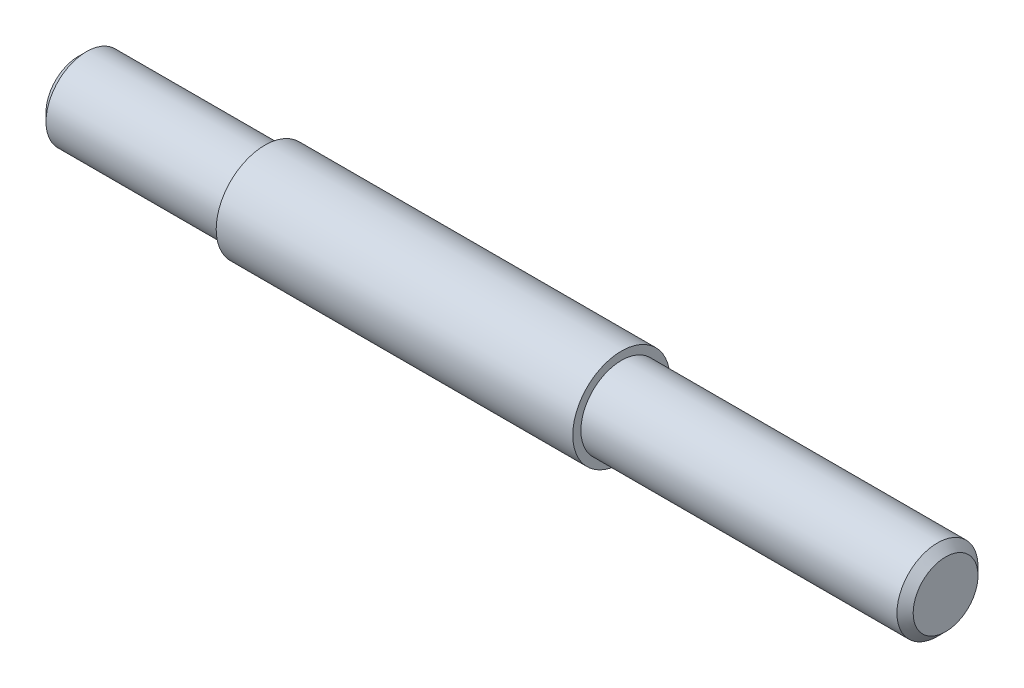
ISO-10303-21;
HEADER;
FILE_DESCRIPTION(('STEP AP214'),'2;1');
FILE_NAME('part.step','',(''),(''),'','','');
FILE_SCHEMA(('AUTOMOTIVE_DESIGN { 1 0 10303 214 1 1 1 1 }'));
ENDSEC;
DATA;
#1=APPLICATION_CONTEXT('core data for automotive mechanical design processes');
#2=APPLICATION_PROTOCOL_DEFINITION('international standard','automotive_design',2000,#1);
#3=PRODUCT_CONTEXT('',#1,'mechanical');
#4=PRODUCT('Part','Part','',(#3));
#5=PRODUCT_RELATED_PRODUCT_CATEGORY('part','',(#4));
#6=PRODUCT_DEFINITION_FORMATION('','',#4);
#7=PRODUCT_DEFINITION_CONTEXT('part definition',#1,'design');
#8=PRODUCT_DEFINITION('design','',#6,#7);
#9=PRODUCT_DEFINITION_SHAPE('','',#8);
#10=(LENGTH_UNIT() NAMED_UNIT(*) SI_UNIT(.MILLI.,.METRE.));
#11=(NAMED_UNIT(*) PLANE_ANGLE_UNIT() SI_UNIT($,.RADIAN.));
#12=(NAMED_UNIT(*) SI_UNIT($,.STERADIAN.) SOLID_ANGLE_UNIT());
#13=UNCERTAINTY_MEASURE_WITH_UNIT(LENGTH_MEASURE(1.E-05),#10,'distance_accuracy_value','');
#14=(GEOMETRIC_REPRESENTATION_CONTEXT(3) GLOBAL_UNCERTAINTY_ASSIGNED_CONTEXT((#13)) GLOBAL_UNIT_ASSIGNED_CONTEXT((#10,
#11,#12)) REPRESENTATION_CONTEXT('',''));
#15=CARTESIAN_POINT('',(0.,0.,0.));
#16=DIRECTION('',(0.,0.,1.));
#17=DIRECTION('',(1.,0.,0.));
#18=AXIS2_PLACEMENT_3D('',#15,#16,#17);
#19=CARTESIAN_POINT('',(0.,0.,0.));
#20=DIRECTION('',(1.,0.,0.));
#21=DIRECTION('',(0.,0.,-1.));
#22=AXIS2_PLACEMENT_3D('',#19,#20,#21);
#23=PLANE('',#22);
#24=CARTESIAN_POINT('',(0.,0.,0.));
#25=DIRECTION('',(1.,0.,0.));
#26=DIRECTION('',(0.,0.,-1.));
#27=AXIS2_PLACEMENT_3D('',#24,#25,#26);
#28=CIRCLE('',#27,3.99999999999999);
#29=CARTESIAN_POINT('',(0.,0.,-4.));
#30=VERTEX_POINT('',#29);
#31=EDGE_CURVE('E48',#30,#30,#28,.F.);
#32=ORIENTED_EDGE('',*,*,#31,.T.);
#33=EDGE_LOOP('',(#32));
#34=FACE_BOUND('',#33,.T.);
#35=ADVANCED_FACE('F34',(#34),#23,.F.);
#36=CARTESIAN_POINT('',(-12.1885906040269,2.22044604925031E-13,0.));
#37=DIRECTION('',(-1.,0.,0.));
#38=DIRECTION('',(0.,0.,1.));
#39=AXIS2_PLACEMENT_3D('',#36,#37,#38);
#40=CYLINDRICAL_SURFACE('',#39,4.99999999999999);
#41=CARTESIAN_POINT('',(0.999999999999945,0.,0.));
#42=DIRECTION('',(1.,0.,0.));
#43=DIRECTION('',(0.,0.,-1.));
#44=AXIS2_PLACEMENT_3D('',#41,#42,#43);
#45=CIRCLE('',#44,4.99999999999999);
#46=CARTESIAN_POINT('',(0.999999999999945,0.,-5.));
#47=VERTEX_POINT('',#46);
#48=EDGE_CURVE('E44',#47,#47,#45,.T.);
#49=ORIENTED_EDGE('',*,*,#48,.T.);
#50=EDGE_LOOP('',(#49));
#51=FACE_BOUND('',#50,.T.);
#52=CARTESIAN_POINT('',(23.,0.,0.));
#53=DIRECTION('',(-1.,0.,0.));
#54=DIRECTION('',(0.,0.,1.));
#55=AXIS2_PLACEMENT_3D('',#52,#53,#54);
#56=CIRCLE('',#55,4.99999999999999);
#57=CARTESIAN_POINT('',(23.,0.,5.));
#58=VERTEX_POINT('',#57);
#59=EDGE_CURVE('E53',#58,#58,#56,.T.);
#60=ORIENTED_EDGE('',*,*,#59,.T.);
#61=EDGE_LOOP('',(#60));
#62=FACE_BOUND('',#61,.T.);
#63=ADVANCED_FACE('F82',(#51,#62),#40,.T.);
#64=CARTESIAN_POINT('',(23.,5.,0.));
#65=DIRECTION('',(1.,0.,0.));
#66=DIRECTION('',(0.,0.,-1.));
#67=AXIS2_PLACEMENT_3D('',#64,#65,#66);
#68=PLANE('',#67);
#69=ORIENTED_EDGE('',*,*,#59,.F.);
#70=EDGE_LOOP('',(#69));
#71=FACE_BOUND('',#70,.T.);
#72=CARTESIAN_POINT('',(23.,0.,0.));
#73=DIRECTION('',(-1.,0.,0.));
#74=DIRECTION('',(0.,0.,1.));
#75=AXIS2_PLACEMENT_3D('',#72,#73,#74);
#76=CIRCLE('',#75,5.99999999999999);
#77=CARTESIAN_POINT('',(23.,0.,6.));
#78=VERTEX_POINT('',#77);
#79=EDGE_CURVE('E56',#78,#78,#76,.T.);
#80=ORIENTED_EDGE('',*,*,#79,.T.);
#81=EDGE_LOOP('',(#80));
#82=FACE_BOUND('',#81,.T.);
#83=ADVANCED_FACE('F87',(#71,#82),#68,.F.);
#84=CARTESIAN_POINT('',(-12.1885906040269,2.22044604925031E-13,0.));
#85=DIRECTION('',(-1.,0.,0.));
#86=DIRECTION('',(0.,0.,1.));
#87=AXIS2_PLACEMENT_3D('',#84,#85,#86);
#88=CYLINDRICAL_SURFACE('',#87,5.99999999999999);
#89=ORIENTED_EDGE('',*,*,#79,.F.);
#90=EDGE_LOOP('',(#89));
#91=FACE_BOUND('',#90,.T.);
#92=CARTESIAN_POINT('',(67.0000000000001,0.,0.));
#93=DIRECTION('',(-1.,0.,0.));
#94=DIRECTION('',(0.,0.,1.));
#95=AXIS2_PLACEMENT_3D('',#92,#93,#94);
#96=CIRCLE('',#95,5.99999999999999);
#97=CARTESIAN_POINT('',(67.0000000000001,0.,6.00000000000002));
#98=VERTEX_POINT('',#97);
#99=EDGE_CURVE('E59',#98,#98,#96,.T.);
#100=ORIENTED_EDGE('',*,*,#99,.T.);
#101=EDGE_LOOP('',(#100));
#102=FACE_BOUND('',#101,.T.);
#103=ADVANCED_FACE('F78',(#91,#102),#88,.T.);
#104=CARTESIAN_POINT('',(67.0000000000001,6.00000000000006,0.));
#105=DIRECTION('',(-1.,0.,0.));
#106=DIRECTION('',(0.,0.,1.));
#107=AXIS2_PLACEMENT_3D('',#104,#105,#106);
#108=PLANE('',#107);
#109=ORIENTED_EDGE('',*,*,#99,.F.);
#110=EDGE_LOOP('',(#109));
#111=FACE_BOUND('',#110,.T.);
#112=CARTESIAN_POINT('',(67.0000000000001,0.,0.));
#113=DIRECTION('',(-1.,0.,0.));
#114=DIRECTION('',(0.,0.,1.));
#115=AXIS2_PLACEMENT_3D('',#112,#113,#114);
#116=CIRCLE('',#115,5.);
#117=CARTESIAN_POINT('',(67.0000000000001,0.,5.00000000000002));
#118=VERTEX_POINT('',#117);
#119=EDGE_CURVE('E62',#118,#118,#116,.T.);
#120=ORIENTED_EDGE('',*,*,#119,.T.);
#121=EDGE_LOOP('',(#120));
#122=FACE_BOUND('',#121,.T.);
#123=ADVANCED_FACE('F66',(#111,#122),#108,.F.);
#124=CARTESIAN_POINT('',(-12.1885906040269,2.22044604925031E-13,0.));
#125=DIRECTION('',(-1.,0.,0.));
#126=DIRECTION('',(0.,0.,1.));
#127=AXIS2_PLACEMENT_3D('',#124,#125,#126);
#128=CYLINDRICAL_SURFACE('',#127,5.);
#129=CARTESIAN_POINT('',(106.,2.22044604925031E-13,0.));
#130=DIRECTION('',(-1.,0.,0.));
#131=DIRECTION('',(0.,0.,1.));
#132=AXIS2_PLACEMENT_3D('',#129,#130,#131);
#133=CIRCLE('',#132,5.);
#134=CARTESIAN_POINT('',(106.,2.22043520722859E-13,5.00000000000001));
#135=VERTEX_POINT('',#134);
#136=EDGE_CURVE('E40',#135,#135,#133,.T.);
#137=ORIENTED_EDGE('',*,*,#136,.T.);
#138=EDGE_LOOP('',(#137));
#139=FACE_BOUND('',#138,.T.);
#140=ORIENTED_EDGE('',*,*,#119,.F.);
#141=EDGE_LOOP('',(#140));
#142=FACE_BOUND('',#141,.T.);
#143=ADVANCED_FACE('F68',(#139,#142),#128,.T.);
#144=CARTESIAN_POINT('',(107.,5.00000000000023,0.));
#145=DIRECTION('',(-1.,0.,0.));
#146=DIRECTION('',(0.,0.,1.));
#147=AXIS2_PLACEMENT_3D('',#144,#145,#146);
#148=PLANE('',#147);
#149=CARTESIAN_POINT('',(107.,2.77555756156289E-13,0.));
#150=DIRECTION('',(-1.,0.,0.));
#151=DIRECTION('',(0.,0.,1.));
#152=AXIS2_PLACEMENT_3D('',#149,#150,#151);
#153=CIRCLE('',#152,3.99999999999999);
#154=CARTESIAN_POINT('',(107.,2.77554888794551E-13,4.00000000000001));
#155=VERTEX_POINT('',#154);
#156=EDGE_CURVE('E10',#155,#155,#153,.F.);
#157=ORIENTED_EDGE('',*,*,#156,.T.);
#158=EDGE_LOOP('',(#157));
#159=FACE_BOUND('',#158,.T.);
#160=ADVANCED_FACE('F70',(#159),#148,.F.);
#161=CARTESIAN_POINT('',(0.,0.,0.));
#162=DIRECTION('',(1.,0.,0.));
#163=DIRECTION('',(0.,0.,-1.));
#164=AXIS2_PLACEMENT_3D('',#161,#162,#163);
#165=CONICAL_SURFACE('',#164,3.99999999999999,0.785398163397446);
#166=ORIENTED_EDGE('',*,*,#48,.F.);
#167=EDGE_LOOP('',(#166));
#168=FACE_BOUND('',#167,.T.);
#169=ORIENTED_EDGE('',*,*,#31,.F.);
#170=EDGE_LOOP('',(#169));
#171=FACE_BOUND('',#170,.T.);
#172=ADVANCED_FACE('F76',(#168,#171),#165,.T.);
#173=CARTESIAN_POINT('',(106.,2.22044604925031E-13,0.));
#174=DIRECTION('',(-1.,0.,0.));
#175=DIRECTION('',(0.,0.,1.));
#176=AXIS2_PLACEMENT_3D('',#173,#174,#175);
#177=CONICAL_SURFACE('',#176,5.,0.785398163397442);
#178=ORIENTED_EDGE('',*,*,#156,.F.);
#179=EDGE_LOOP('',(#178));
#180=FACE_BOUND('',#179,.T.);
#181=ORIENTED_EDGE('',*,*,#136,.F.);
#182=EDGE_LOOP('',(#181));
#183=FACE_BOUND('',#182,.T.);
#184=ADVANCED_FACE('F92',(#180,#183),#177,.T.);
#185=CLOSED_SHELL('',(#35,#63,#83,#103,#123,#143,#160,#172,#184));
#186=MANIFOLD_SOLID_BREP('B2',#185);
#187=ADVANCED_BREP_SHAPE_REPRESENTATION('',(#18,#186),#14);
#188=SHAPE_DEFINITION_REPRESENTATION(#9,#187);
ENDSEC;
END-ISO-10303-21;
